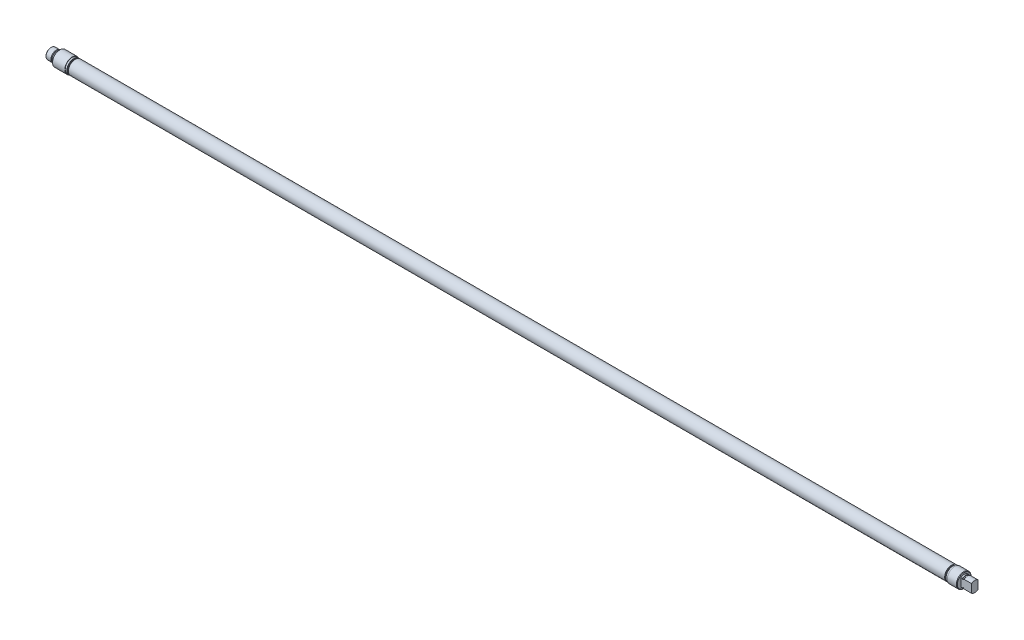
ISO-10303-21;
HEADER;
FILE_DESCRIPTION(('STEP AP214'),'2;1');
FILE_NAME('part.step','',(''),(''),'','','');
FILE_SCHEMA(('AUTOMOTIVE_DESIGN { 1 0 10303 214 1 1 1 1 }'));
ENDSEC;
DATA;
#1=APPLICATION_CONTEXT('core data for automotive mechanical design processes');
#2=APPLICATION_PROTOCOL_DEFINITION('international standard','automotive_design',2000,#1);
#3=PRODUCT_CONTEXT('',#1,'mechanical');
#4=PRODUCT('Part','Part','',(#3));
#5=PRODUCT_RELATED_PRODUCT_CATEGORY('part','',(#4));
#6=PRODUCT_DEFINITION_FORMATION('','',#4);
#7=PRODUCT_DEFINITION_CONTEXT('part definition',#1,'design');
#8=PRODUCT_DEFINITION('design','',#6,#7);
#9=PRODUCT_DEFINITION_SHAPE('','',#8);
#10=(LENGTH_UNIT() NAMED_UNIT(*) SI_UNIT(.MILLI.,.METRE.));
#11=(NAMED_UNIT(*) PLANE_ANGLE_UNIT() SI_UNIT($,.RADIAN.));
#12=(NAMED_UNIT(*) SI_UNIT($,.STERADIAN.) SOLID_ANGLE_UNIT());
#13=UNCERTAINTY_MEASURE_WITH_UNIT(LENGTH_MEASURE(1.E-05),#10,'distance_accuracy_value','');
#14=(GEOMETRIC_REPRESENTATION_CONTEXT(3) GLOBAL_UNCERTAINTY_ASSIGNED_CONTEXT((#13)) GLOBAL_UNIT_ASSIGNED_CONTEXT((#10,
#11,#12)) REPRESENTATION_CONTEXT('',''));
#15=CARTESIAN_POINT('',(0.,0.,0.));
#16=DIRECTION('',(0.,0.,1.));
#17=DIRECTION('',(1.,0.,0.));
#18=AXIS2_PLACEMENT_3D('',#15,#16,#17);
#19=CARTESIAN_POINT('',(-21.4174471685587,0.,0.));
#20=DIRECTION('',(-1.,0.,0.));
#21=DIRECTION('',(0.,0.,1.));
#22=AXIS2_PLACEMENT_3D('',#19,#20,#21);
#23=CYLINDRICAL_SURFACE('',#22,7.9121);
#24=CARTESIAN_POINT('',(1375.537,0.,0.));
#25=DIRECTION('',(-1.,0.,0.));
#26=DIRECTION('',(0.,0.,1.));
#27=AXIS2_PLACEMENT_3D('',#24,#25,#26);
#28=CIRCLE('',#27,7.9121);
#29=CARTESIAN_POINT('',(1375.537,-6.26985250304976,-4.82600000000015));
#30=VERTEX_POINT('',#29);
#31=CARTESIAN_POINT('',(1375.537,-6.26985250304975,4.82599999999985));
#32=VERTEX_POINT('',#31);
#33=EDGE_CURVE('E224',#30,#32,#28,.T.);
#34=ORIENTED_EDGE('',*,*,#33,.T.);
#35=DIRECTION('',(-1.,0.,0.));
#36=VECTOR('',#35,1.);
#37=CARTESIAN_POINT('',(-21.4174471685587,-6.26985250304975,4.82600000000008));
#38=LINE('',#37,#36);
#39=CARTESIAN_POINT('',(1364.3991,-6.26985250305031,4.82599999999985));
#40=VERTEX_POINT('',#39);
#41=EDGE_CURVE('E343',#32,#40,#38,.T.);
#42=ORIENTED_EDGE('',*,*,#41,.T.);
#43=CARTESIAN_POINT('',(1364.3991,0.,0.));
#44=DIRECTION('',(-1.,0.,0.));
#45=DIRECTION('',(0.,0.,1.));
#46=AXIS2_PLACEMENT_3D('',#43,#44,#45);
#47=CIRCLE('',#46,7.9121);
#48=CARTESIAN_POINT('',(1364.3991,-6.2698525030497,-4.82600000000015));
#49=VERTEX_POINT('',#48);
#50=EDGE_CURVE('E223',#49,#40,#47,.T.);
#51=ORIENTED_EDGE('',*,*,#50,.F.);
#52=DIRECTION('',(-1.,0.,0.));
#53=VECTOR('',#52,1.);
#54=CARTESIAN_POINT('',(-21.4174471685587,-6.26985250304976,-4.82600000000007));
#55=LINE('',#54,#53);
#56=EDGE_CURVE('E355',#49,#30,#55,.F.);
#57=ORIENTED_EDGE('',*,*,#56,.T.);
#58=EDGE_LOOP('',(#34,#42,#51,#57));
#59=FACE_BOUND('',#58,.T.);
#60=ADVANCED_FACE('F33',(#59),#23,.T.);
#61=CARTESIAN_POINT('',(1364.3991,0.,0.));
#62=DIRECTION('',(1.,0.,0.));
#63=DIRECTION('',(0.,0.,-1.));
#64=AXIS2_PLACEMENT_3D('',#61,#62,#63);
#65=CONICAL_SURFACE('',#64,7.9121,0.785398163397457);
#66=ORIENTED_EDGE('',*,*,#50,.T.);
#67=CARTESIAN_POINT('',(1373.90594860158,-16.7370694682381,4.82599999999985));
#68=CARTESIAN_POINT('',(1373.58662614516,-16.4047233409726,4.82599999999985));
#69=CARTESIAN_POINT('',(1373.26766915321,-16.0720250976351,4.82599999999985));
#70=CARTESIAN_POINT('',(1372.63066396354,-15.4057544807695,4.82599999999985));
#71=CARTESIAN_POINT('',(1372.31261577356,-15.0721820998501,4.82599999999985));
#72=CARTESIAN_POINT('',(1371.67751664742,-14.4038991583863,4.82599999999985));
#73=CARTESIAN_POINT('',(1371.36046603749,-14.0691882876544,4.82599999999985));
#74=CARTESIAN_POINT('',(1370.72770725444,-13.3985015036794,4.82599999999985));
#75=CARTESIAN_POINT('',(1370.41199907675,-13.0625255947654,4.82599999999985));
#76=CARTESIAN_POINT('',(1369.78534503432,-12.392323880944,4.82599999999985));
#77=CARTESIAN_POINT('',(1369.47438286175,-12.0581133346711,4.82599999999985));
#78=CARTESIAN_POINT('',(1368.85452235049,-11.3877842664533,4.82599999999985));
#79=CARTESIAN_POINT('',(1368.54562400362,-11.0516657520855,4.82599999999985));
#80=CARTESIAN_POINT('',(1367.93052154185,-10.3770472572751,4.82599999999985));
#81=CARTESIAN_POINT('',(1367.62431709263,-10.0385475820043,4.82599999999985));
#82=CARTESIAN_POINT('',(1367.01540490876,-9.35842140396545,4.82599999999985));
#83=CARTESIAN_POINT('',(1366.71269710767,-9.01679496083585,4.82599999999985));
#84=CARTESIAN_POINT('',(1366.18235482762,-8.40987321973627,4.82599999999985));
#85=CARTESIAN_POINT('',(1365.95373920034,-8.14543625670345,4.82599999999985));
#86=CARTESIAN_POINT('',(1365.50008982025,-7.61346524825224,4.82599999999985));
#87=CARTESIAN_POINT('',(1365.27505633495,-7.3459309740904,4.82599999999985));
#88=CARTESIAN_POINT('',(1364.82837422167,-6.80526290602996,4.82599999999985));
#89=CARTESIAN_POINT('',(1364.60675499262,-6.53210476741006,4.82599999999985));
#90=CARTESIAN_POINT('',(1364.17008432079,-5.98063379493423,4.82599999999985));
#91=CARTESIAN_POINT('',(1363.95503163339,-5.70232195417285,4.82599999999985));
#92=CARTESIAN_POINT('',(1363.63835391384,-5.27830105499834,4.82599999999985));
#93=CARTESIAN_POINT('',(1363.53328667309,-5.13516306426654,4.82599999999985));
#94=CARTESIAN_POINT('',(1363.32600872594,-4.84683695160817,4.82599999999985));
#95=CARTESIAN_POINT('',(1363.22379789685,-4.70164891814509,4.82599999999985));
#96=CARTESIAN_POINT('',(1363.02273516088,-4.40873141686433,4.82599999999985));
#97=CARTESIAN_POINT('',(1362.9238869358,-4.26099941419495,4.82599999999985));
#98=CARTESIAN_POINT('',(1362.73046369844,-3.96275813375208,4.82599999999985));
#99=CARTESIAN_POINT('',(1362.63588857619,-3.81224892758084,4.82599999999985));
#100=CARTESIAN_POINT('',(1362.45260166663,-3.50893747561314,4.82599999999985));
#101=CARTESIAN_POINT('',(1362.36385763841,-3.35615481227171,4.82599999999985));
#102=CARTESIAN_POINT('',(1362.19290845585,-3.04691994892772,4.82599999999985));
#103=CARTESIAN_POINT('',(1362.11070427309,-2.89046720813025,4.82599999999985));
#104=CARTESIAN_POINT('',(1361.95468120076,-2.57375531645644,4.82599999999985));
#105=CARTESIAN_POINT('',(1361.88084725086,-2.41350365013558,4.82599999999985));
#106=CARTESIAN_POINT('',(1361.74353326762,-2.08866262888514,4.82599999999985));
#107=CARTESIAN_POINT('',(1361.68004829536,-1.92407538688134,4.82599999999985));
#108=CARTESIAN_POINT('',(1361.56721256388,-1.59427630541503,4.82599999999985));
#109=CARTESIAN_POINT('',(1361.51757109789,-1.42916531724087,4.82599999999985));
#110=CARTESIAN_POINT('',(1361.4330687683,-1.0951641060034,4.82599999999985));
#111=CARTESIAN_POINT('',(1361.39820548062,-0.926274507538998,4.82599999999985));
#112=CARTESIAN_POINT('',(1361.34568462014,-0.586884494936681,4.82599999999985));
#113=CARTESIAN_POINT('',(1361.32791923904,-0.416401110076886,4.82599999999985));
#114=CARTESIAN_POINT('',(1361.31055646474,-0.0745027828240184,4.82599999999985));
#115=CARTESIAN_POINT('',(1361.31095771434,0.0969120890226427,4.82599999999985));
#116=CARTESIAN_POINT('',(1361.32988746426,0.438617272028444,4.82599999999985));
#117=CARTESIAN_POINT('',(1361.34840570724,0.60890816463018,4.82599999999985));
#118=CARTESIAN_POINT('',(1361.40216603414,0.946807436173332,4.82599999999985));
#119=CARTESIAN_POINT('',(1361.43741147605,1.11441526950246,4.82599999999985));
#120=CARTESIAN_POINT('',(1361.52270340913,1.44710546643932,4.82599999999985));
#121=CARTESIAN_POINT('',(1361.57285960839,1.61215921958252,4.82599999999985));
#122=CARTESIAN_POINT('',(1361.68533860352,1.93799977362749,4.82599999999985));
#123=CARTESIAN_POINT('',(1361.74766126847,2.09878662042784,4.82599999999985));
#124=CARTESIAN_POINT('',(1361.90172768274,2.46241963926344,4.82599999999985));
#125=CARTESIAN_POINT('',(1361.99675220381,2.66386534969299,4.82599999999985));
#126=CARTESIAN_POINT('',(1362.19909667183,3.06053751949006,4.82599999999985));
#127=CARTESIAN_POINT('',(1362.30642427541,3.2557600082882,4.82599999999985));
#128=CARTESIAN_POINT('',(1362.53052836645,3.64123509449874,4.82599999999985));
#129=CARTESIAN_POINT('',(1362.64732513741,3.83147580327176,4.82599999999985));
#130=CARTESIAN_POINT('',(1362.88790699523,4.20739530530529,4.82599999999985));
#131=CARTESIAN_POINT('',(1363.01169055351,4.39307508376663,4.82599999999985));
#132=CARTESIAN_POINT('',(1363.26597082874,4.76259550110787,4.82599999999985));
#133=CARTESIAN_POINT('',(1363.3965236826,4.94639732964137,4.82599999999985));
#134=CARTESIAN_POINT('',(1363.66194794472,5.31085556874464,4.82599999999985));
#135=CARTESIAN_POINT('',(1363.79681953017,5.49151184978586,4.82599999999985));
#136=CARTESIAN_POINT('',(1364.06979804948,5.84995870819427,4.82599999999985));
#137=CARTESIAN_POINT('',(1364.20790021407,6.02775292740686,4.82599999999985));
#138=CARTESIAN_POINT('',(1364.48685645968,6.38115864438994,4.82599999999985));
#139=CARTESIAN_POINT('',(1364.62771048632,6.55677018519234,4.82599999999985));
#140=CARTESIAN_POINT('',(1364.95291531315,6.95691921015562,4.82599999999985));
#141=CARTESIAN_POINT('',(1365.13801407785,7.18084819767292,4.82599999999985));
#142=CARTESIAN_POINT('',(1365.51114634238,7.62625117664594,4.82599999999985));
#143=CARTESIAN_POINT('',(1365.69917991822,7.84772510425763,4.82599999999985));
#144=CARTESIAN_POINT('',(1366.07760458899,8.28868097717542,4.82599999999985));
#145=CARTESIAN_POINT('',(1366.26799589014,8.5081627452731,4.82599999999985));
#146=CARTESIAN_POINT('',(1366.65068109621,8.94546255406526,4.82599999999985));
#147=CARTESIAN_POINT('',(1366.84297501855,9.16328057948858,4.82599999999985));
#148=CARTESIAN_POINT('',(1367.42255153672,9.81507831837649,4.82599999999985));
#149=CARTESIAN_POINT('',(1367.81216723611,10.2469830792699,4.82599999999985));
#150=CARTESIAN_POINT('',(1368.59569783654,11.1068205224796,4.82599999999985));
#151=CARTESIAN_POINT('',(1368.98961251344,11.5347534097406,4.82599999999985));
#152=CARTESIAN_POINT('',(1369.75804605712,12.3633732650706,4.82599999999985));
#153=CARTESIAN_POINT('',(1370.13239015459,12.7642224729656,4.82599999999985));
#154=CARTESIAN_POINT('',(1370.88322300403,13.5639176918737,4.82599999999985));
#155=CARTESIAN_POINT('',(1371.25971179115,13.9627636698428,4.82599999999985));
#156=CARTESIAN_POINT('',(1372.0137476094,14.7582414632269,4.82599999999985));
#157=CARTESIAN_POINT('',(1372.39129198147,15.1548758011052,4.82599999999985));
#158=CARTESIAN_POINT('',(1373.14770508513,15.9468593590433,4.82599999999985));
#159=CARTESIAN_POINT('',(1373.52657378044,16.3422086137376,4.82599999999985));
#160=CARTESIAN_POINT('',(1373.90594860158,16.7370694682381,4.82599999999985));
#161=B_SPLINE_CURVE_WITH_KNOTS('',3,(#67,#68,#69,#70,#71,#72,#73,#74,#75,#76,#77,#78,#79,#80,
#81,#82,#83,#84,#85,#86,#87,#88,#89,#90,#91,#92,#93,#94,#95,#96,#97,#98,#99,#100,#101,#102,#103,
#104,#105,#106,#107,#108,#109,#110,#111,#112,#113,#114,#115,#116,#117,#118,#119,#120,#121,#122,
#123,#124,#125,#126,#127,#128,#129,#130,#131,#132,#133,#134,#135,#136,#137,#138,#139,#140,#141,
#142,#143,#144,#145,#146,#147,#148,#149,#150,#151,#152,#153,#154,#155,#156,#157,#158,#159,#160),
.UNSPECIFIED.,.F.,.F.,(4,2,2,2,2,2,2,2,2,2,2,2,2,2,2,2,2,2,2,2,2,2,2,2,2,2,2,2,2,2,2,2,2,2,2,2,
2,2,2,2,2,2,2,2,2,2,4),(0.,1.38267463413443,2.76536099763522,4.14846033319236,5.53155494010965,
6.90105453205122,8.27054868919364,9.63987041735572,11.0091660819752,12.0578217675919,
13.1065553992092,14.1617507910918,15.2167449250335,15.7493982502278,16.282028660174,
16.8152246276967,17.3484068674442,17.8783374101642,18.4083465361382,18.9373863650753,
19.4661729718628,19.9828350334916,20.4994123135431,21.0127106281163,21.5259705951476,
22.0389401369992,22.5520127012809,23.068957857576,23.5858974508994,24.2535082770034,
24.9215368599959,25.5910362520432,26.2603897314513,26.936657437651,27.6129529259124,
28.2883061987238,28.9636461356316,29.8351924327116,30.7067613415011,31.5784070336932,
32.4500607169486,34.1950274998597,35.9399037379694,37.5852877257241,39.2306987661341,
40.8734756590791,42.5162079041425),.UNSPECIFIED.);
#162=CARTESIAN_POINT('',(1363.599,-5.22400880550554,4.82600000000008));
#163=VERTEX_POINT('',#162);
#164=EDGE_CURVE('E510',#40,#163,#161,.T.);
#165=ORIENTED_EDGE('',*,*,#164,.T.);
#166=CARTESIAN_POINT('',(1363.599,0.,0.));
#167=DIRECTION('',(-1.,0.,0.));
#168=DIRECTION('',(0.,0.,1.));
#169=AXIS2_PLACEMENT_3D('',#166,#167,#168);
#170=CIRCLE('',#169,7.11200000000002);
#171=CARTESIAN_POINT('',(1363.599,-5.22400880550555,-4.82600000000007));
#172=VERTEX_POINT('',#171);
#173=EDGE_CURVE('E232',#172,#163,#170,.T.);
#174=ORIENTED_EDGE('',*,*,#173,.F.);
#175=CARTESIAN_POINT('',(1373.90594860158,16.737069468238,-4.82600000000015));
#176=CARTESIAN_POINT('',(1373.58662614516,16.4047233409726,-4.82600000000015));
#177=CARTESIAN_POINT('',(1373.26766915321,16.0720250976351,-4.82600000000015));
#178=CARTESIAN_POINT('',(1372.63066396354,15.4057544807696,-4.82600000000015));
#179=CARTESIAN_POINT('',(1372.31261577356,15.0721820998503,-4.82600000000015));
#180=CARTESIAN_POINT('',(1371.67751664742,14.4038991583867,-4.82600000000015));
#181=CARTESIAN_POINT('',(1371.36046603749,14.0691882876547,-4.82600000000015));
#182=CARTESIAN_POINT('',(1370.72770725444,13.3985015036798,-4.82600000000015));
#183=CARTESIAN_POINT('',(1370.41199907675,13.0625255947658,-4.82600000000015));
#184=CARTESIAN_POINT('',(1369.78534503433,12.3923238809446,-4.82600000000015));
#185=CARTESIAN_POINT('',(1369.47438286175,12.0581133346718,-4.82600000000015));
#186=CARTESIAN_POINT('',(1368.85452235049,11.3877842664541,-4.82600000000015));
#187=CARTESIAN_POINT('',(1368.54562400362,11.0516657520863,-4.82600000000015));
#188=CARTESIAN_POINT('',(1367.93052154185,10.3770472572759,-4.82600000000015));
#189=CARTESIAN_POINT('',(1367.62431709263,10.0385475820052,-4.82600000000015));
#190=CARTESIAN_POINT('',(1367.01540490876,9.35842140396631,-4.82600000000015));
#191=CARTESIAN_POINT('',(1366.71269710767,9.01679496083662,-4.82600000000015));
#192=CARTESIAN_POINT('',(1366.18235482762,8.40987321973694,-4.82600000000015));
#193=CARTESIAN_POINT('',(1365.95373920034,8.14543625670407,-4.82600000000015));
#194=CARTESIAN_POINT('',(1365.50008982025,7.61346524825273,-4.82600000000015));
#195=CARTESIAN_POINT('',(1365.27505633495,7.34593097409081,-4.82600000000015));
#196=CARTESIAN_POINT('',(1364.82837422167,6.8052629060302,-4.82600000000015));
#197=CARTESIAN_POINT('',(1364.60675499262,6.5321047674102,-4.82600000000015));
#198=CARTESIAN_POINT('',(1364.17008432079,5.98063379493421,-4.82600000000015));
#199=CARTESIAN_POINT('',(1363.95503163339,5.70232195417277,-4.82600000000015));
#200=CARTESIAN_POINT('',(1363.63835391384,5.27830105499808,-4.82600000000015));
#201=CARTESIAN_POINT('',(1363.53328667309,5.13516306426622,-4.82600000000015));
#202=CARTESIAN_POINT('',(1363.32600872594,4.84683695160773,-4.82600000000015));
#203=CARTESIAN_POINT('',(1363.22379789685,4.7016489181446,-4.82600000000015));
#204=CARTESIAN_POINT('',(1363.02273516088,4.40873141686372,-4.82600000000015));
#205=CARTESIAN_POINT('',(1362.9238869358,4.26099941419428,-4.82600000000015));
#206=CARTESIAN_POINT('',(1362.73046369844,3.96275813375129,-4.82600000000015));
#207=CARTESIAN_POINT('',(1362.63588857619,3.81224892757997,-4.82600000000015));
#208=CARTESIAN_POINT('',(1362.45260166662,3.50893747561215,-4.82600000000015));
#209=CARTESIAN_POINT('',(1362.36385763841,3.35615481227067,-4.82600000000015));
#210=CARTESIAN_POINT('',(1362.19290845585,3.04691994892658,-4.82600000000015));
#211=CARTESIAN_POINT('',(1362.11070427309,2.89046720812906,-4.82600000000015));
#212=CARTESIAN_POINT('',(1361.95468120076,2.57375531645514,-4.82600000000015));
#213=CARTESIAN_POINT('',(1361.88084725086,2.41350365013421,-4.82600000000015));
#214=CARTESIAN_POINT('',(1361.74353326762,2.08866262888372,-4.82600000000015));
#215=CARTESIAN_POINT('',(1361.68004829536,1.92407538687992,-4.82600000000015));
#216=CARTESIAN_POINT('',(1361.56721256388,1.5942763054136,-4.82600000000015));
#217=CARTESIAN_POINT('',(1361.51757109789,1.4291653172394,-4.82600000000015));
#218=CARTESIAN_POINT('',(1361.4330687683,1.09516410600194,-4.82600000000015));
#219=CARTESIAN_POINT('',(1361.39820548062,0.926274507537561,-4.82600000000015));
#220=CARTESIAN_POINT('',(1361.34568462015,0.58688449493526,-4.82600000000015));
#221=CARTESIAN_POINT('',(1361.32791923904,0.416401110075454,-4.82600000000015));
#222=CARTESIAN_POINT('',(1361.31055646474,0.0745027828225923,-4.82600000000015));
#223=CARTESIAN_POINT('',(1361.31095771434,-0.0969120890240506,-4.82600000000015));
#224=CARTESIAN_POINT('',(1361.32988746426,-0.438617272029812,-4.82600000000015));
#225=CARTESIAN_POINT('',(1361.34840570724,-0.608908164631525,-4.82600000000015));
#226=CARTESIAN_POINT('',(1361.40216603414,-0.946807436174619,-4.82600000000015));
#227=CARTESIAN_POINT('',(1361.43741147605,-1.11441526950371,-4.82600000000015));
#228=CARTESIAN_POINT('',(1361.52270340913,-1.44710546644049,-4.82600000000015));
#229=CARTESIAN_POINT('',(1361.57285960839,-1.61215921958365,-4.82600000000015));
#230=CARTESIAN_POINT('',(1361.68533860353,-1.93799977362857,-4.82600000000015));
#231=CARTESIAN_POINT('',(1361.74766126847,-2.09878662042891,-4.82600000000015));
#232=CARTESIAN_POINT('',(1361.90172768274,-2.46241963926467,-4.82600000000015));
#233=CARTESIAN_POINT('',(1361.99675220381,-2.66386534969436,-4.82600000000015));
#234=CARTESIAN_POINT('',(1362.19909667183,-3.06053751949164,-4.82600000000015));
#235=CARTESIAN_POINT('',(1362.30642427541,-3.25576000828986,-4.82600000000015));
#236=CARTESIAN_POINT('',(1362.53052836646,-3.64123509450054,-4.82600000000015));
#237=CARTESIAN_POINT('',(1362.64732513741,-3.83147580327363,-4.82600000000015));
#238=CARTESIAN_POINT('',(1362.88790699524,-4.20739530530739,-4.82600000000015));
#239=CARTESIAN_POINT('',(1363.01169055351,-4.39307508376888,-4.82600000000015));
#240=CARTESIAN_POINT('',(1363.26597082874,-4.76259550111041,-4.82600000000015));
#241=CARTESIAN_POINT('',(1363.3965236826,-4.94639732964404,-4.82600000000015));
#242=CARTESIAN_POINT('',(1363.66194794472,-5.31085556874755,-4.82600000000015));
#243=CARTESIAN_POINT('',(1363.79681953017,-5.49151184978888,-4.82600000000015));
#244=CARTESIAN_POINT('',(1364.06979804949,-5.84995870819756,-4.82600000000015));
#245=CARTESIAN_POINT('',(1364.20790021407,-6.02775292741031,-4.82600000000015));
#246=CARTESIAN_POINT('',(1364.48685645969,-6.38115864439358,-4.82600000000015));
#247=CARTESIAN_POINT('',(1364.62771048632,-6.556770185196,-4.82600000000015));
#248=CARTESIAN_POINT('',(1364.95291531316,-6.95691921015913,-4.82600000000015));
#249=CARTESIAN_POINT('',(1365.13801407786,-7.18084819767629,-4.82600000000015));
#250=CARTESIAN_POINT('',(1365.51114634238,-7.62625117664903,-4.82600000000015));
#251=CARTESIAN_POINT('',(1365.69917991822,-7.84772510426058,-4.82600000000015));
#252=CARTESIAN_POINT('',(1366.07760458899,-8.28868097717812,-4.82600000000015));
#253=CARTESIAN_POINT('',(1366.26799589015,-8.50816274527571,-4.82600000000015));
#254=CARTESIAN_POINT('',(1366.65068109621,-8.94546255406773,-4.82600000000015));
#255=CARTESIAN_POINT('',(1366.84297501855,-9.16328057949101,-4.82600000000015));
#256=CARTESIAN_POINT('',(1367.42255153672,-9.81507831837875,-4.82600000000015));
#257=CARTESIAN_POINT('',(1367.81216723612,-10.2469830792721,-4.82600000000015));
#258=CARTESIAN_POINT('',(1368.59569783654,-11.1068205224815,-4.82600000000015));
#259=CARTESIAN_POINT('',(1368.98961251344,-11.5347534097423,-4.82600000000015));
#260=CARTESIAN_POINT('',(1369.75804605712,-12.3633732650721,-4.82600000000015));
#261=CARTESIAN_POINT('',(1370.13239015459,-12.764222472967,-4.82600000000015));
#262=CARTESIAN_POINT('',(1370.88322300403,-13.5639176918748,-4.82600000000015));
#263=CARTESIAN_POINT('',(1371.25971179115,-13.9627636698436,-4.82600000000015));
#264=CARTESIAN_POINT('',(1372.0137476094,-14.7582414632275,-4.82600000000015));
#265=CARTESIAN_POINT('',(1372.39129198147,-15.1548758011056,-4.82600000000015));
#266=CARTESIAN_POINT('',(1373.14770508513,-15.9468593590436,-4.82600000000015));
#267=CARTESIAN_POINT('',(1373.52657378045,-16.3422086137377,-4.82600000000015));
#268=CARTESIAN_POINT('',(1373.90594860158,-16.7370694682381,-4.82600000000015));
#269=B_SPLINE_CURVE_WITH_KNOTS('',3,(#175,#176,#177,#178,#179,#180,#181,#182,#183,#184,#185,
#186,#187,#188,#189,#190,#191,#192,#193,#194,#195,#196,#197,#198,#199,#200,#201,#202,#203,#204,
#205,#206,#207,#208,#209,#210,#211,#212,#213,#214,#215,#216,#217,#218,#219,#220,#221,#222,#223,
#224,#225,#226,#227,#228,#229,#230,#231,#232,#233,#234,#235,#236,#237,#238,#239,#240,#241,#242,
#243,#244,#245,#246,#247,#248,#249,#250,#251,#252,#253,#254,#255,#256,#257,#258,#259,#260,#261,
#262,#263,#264,#265,#266,#267,#268),.UNSPECIFIED.,.F.,.F.,(4,2,2,2,2,2,2,2,2,2,2,2,2,2,2,2,2,2,
2,2,2,2,2,2,2,2,2,2,2,2,2,2,2,2,2,2,2,2,2,2,2,2,2,2,2,2,4),(0.,1.3826746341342,2.76536099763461,
4.14846033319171,5.53155494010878,6.90105453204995,8.2705486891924,9.63987041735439,
11.009166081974,12.057821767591,13.1065553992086,14.1617507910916,15.2167449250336,
15.749398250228,16.2820286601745,16.8152246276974,17.348406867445,17.8783374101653,
18.4083465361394,18.9373863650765,19.4661729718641,19.9828350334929,20.4994123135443,
21.0127106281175,21.5259705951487,22.0389401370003,22.5520127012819,23.0689578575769,
23.5858974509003,24.2535082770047,24.9215368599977,25.5910362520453,26.2603897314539,
26.9366574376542,27.6129529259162,28.288306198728,28.9636461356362,29.8351924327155,
30.7067613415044,31.5784070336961,32.4500607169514,34.195027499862,35.9399037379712,
37.5852877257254,39.2306987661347,40.8734756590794,42.516207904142),.UNSPECIFIED.);
#270=EDGE_CURVE('E264',#172,#49,#269,.T.);
#271=ORIENTED_EDGE('',*,*,#270,.T.);
#272=EDGE_LOOP('',(#66,#165,#174,#271));
#273=FACE_BOUND('',#272,.T.);
#274=ADVANCED_FACE('F189',(#273),#65,.T.);
#275=CARTESIAN_POINT('',(-21.4174471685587,0.,0.));
#276=DIRECTION('',(-1.,0.,0.));
#277=DIRECTION('',(0.,0.,1.));
#278=AXIS2_PLACEMENT_3D('',#275,#276,#277);
#279=CYLINDRICAL_SURFACE('',#278,7.11200000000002);
#280=ORIENTED_EDGE('',*,*,#173,.T.);
#281=DIRECTION('',(-1.,0.,0.));
#282=VECTOR('',#281,1.);
#283=CARTESIAN_POINT('',(-21.4174471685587,-5.22400880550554,4.82600000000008));
#284=LINE('',#283,#282);
#285=CARTESIAN_POINT('',(1362.075,-5.22400880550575,4.82599999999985));
#286=VERTEX_POINT('',#285);
#287=EDGE_CURVE('E507',#163,#286,#284,.T.);
#288=ORIENTED_EDGE('',*,*,#287,.T.);
#289=CARTESIAN_POINT('',(1362.075,0.,0.));
#290=DIRECTION('',(-1.,0.,0.));
#291=DIRECTION('',(0.,0.,1.));
#292=AXIS2_PLACEMENT_3D('',#289,#290,#291);
#293=CIRCLE('',#292,7.11200000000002);
#294=CARTESIAN_POINT('',(1362.075,-5.22400880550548,-4.82600000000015));
#295=VERTEX_POINT('',#294);
#296=EDGE_CURVE('E235',#295,#286,#293,.T.);
#297=ORIENTED_EDGE('',*,*,#296,.F.);
#298=DIRECTION('',(-1.,0.,0.));
#299=VECTOR('',#298,1.);
#300=CARTESIAN_POINT('',(-21.4174471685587,-5.22400880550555,-4.82600000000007));
#301=LINE('',#300,#299);
#302=EDGE_CURVE('E348',#295,#172,#301,.F.);
#303=ORIENTED_EDGE('',*,*,#302,.T.);
#304=EDGE_LOOP('',(#280,#288,#297,#303));
#305=FACE_BOUND('',#304,.T.);
#306=ADVANCED_FACE('F196',(#305),#279,.T.);
#307=CARTESIAN_POINT('',(1362.075,7.9121,0.));
#308=DIRECTION('',(-1.,0.,0.));
#309=DIRECTION('',(0.,0.,1.));
#310=AXIS2_PLACEMENT_3D('',#307,#308,#309);
#311=PLANE('',#310);
#312=CARTESIAN_POINT('',(1362.075,0.,0.));
#313=DIRECTION('',(-1.,0.,0.));
#314=DIRECTION('',(0.,0.,1.));
#315=AXIS2_PLACEMENT_3D('',#312,#313,#314);
#316=CIRCLE('',#315,7.9121);
#317=CARTESIAN_POINT('',(1362.075,6.26985250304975,4.82600000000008));
#318=VERTEX_POINT('',#317);
#319=CARTESIAN_POINT('',(1362.075,6.26985250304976,-4.82600000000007));
#320=VERTEX_POINT('',#319);
#321=EDGE_CURVE('E237',#318,#320,#316,.T.);
#322=ORIENTED_EDGE('',*,*,#321,.F.);
#323=DIRECTION('',(0.,-1.,0.));
#324=VECTOR('',#323,1.);
#325=CARTESIAN_POINT('',(1362.075,7.9121,4.82599999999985));
#326=LINE('',#325,#324);
#327=CARTESIAN_POINT('',(1362.075,5.22400880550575,4.82599999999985));
#328=VERTEX_POINT('',#327);
#329=EDGE_CURVE('E48',#318,#328,#326,.T.);
#330=ORIENTED_EDGE('',*,*,#329,.T.);
#331=CARTESIAN_POINT('',(1362.075,5.22400880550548,-4.82600000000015));
#332=VERTEX_POINT('',#331);
#333=EDGE_CURVE('E234',#328,#332,#293,.T.);
#334=ORIENTED_EDGE('',*,*,#333,.T.);
#335=DIRECTION('',(0.,1.,0.));
#336=VECTOR('',#335,1.);
#337=CARTESIAN_POINT('',(1362.075,7.9121,-4.82600000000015));
#338=LINE('',#337,#336);
#339=EDGE_CURVE('E247',#332,#320,#338,.T.);
#340=ORIENTED_EDGE('',*,*,#339,.T.);
#341=EDGE_LOOP('',(#322,#330,#334,#340));
#342=FACE_BOUND('',#341,.T.);
#343=ADVANCED_FACE('F246',(#342),#311,.F.);
#344=CARTESIAN_POINT('',(-21.4174471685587,0.,0.));
#345=DIRECTION('',(-1.,0.,0.));
#346=DIRECTION('',(0.,0.,1.));
#347=AXIS2_PLACEMENT_3D('',#344,#345,#346);
#348=CYLINDRICAL_SURFACE('',#347,7.9121);
#349=CARTESIAN_POINT('',(1362.075,-6.26985250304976,-4.82600000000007));
#350=VERTEX_POINT('',#349);
#351=CARTESIAN_POINT('',(1362.075,-6.26985250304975,4.82600000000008));
#352=VERTEX_POINT('',#351);
#353=EDGE_CURVE('E137',#350,#352,#316,.T.);
#354=ORIENTED_EDGE('',*,*,#353,.T.);
#355=DIRECTION('',(-1.,0.,0.));
#356=VECTOR('',#355,1.);
#357=CARTESIAN_POINT('',(-21.4174471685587,-6.26985250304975,4.82600000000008));
#358=LINE('',#357,#356);
#359=CARTESIAN_POINT('',(1359.789,-6.26985250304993,4.82599999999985));
#360=VERTEX_POINT('',#359);
#361=EDGE_CURVE('E124',#352,#360,#358,.T.);
#362=ORIENTED_EDGE('',*,*,#361,.T.);
#363=CARTESIAN_POINT('',(1359.789,0.,0.));
#364=DIRECTION('',(-1.,0.,0.));
#365=DIRECTION('',(0.,0.,1.));
#366=AXIS2_PLACEMENT_3D('',#363,#364,#365);
#367=CIRCLE('',#366,7.9121);
#368=CARTESIAN_POINT('',(1359.789,-6.2698525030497,-4.82600000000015));
#369=VERTEX_POINT('',#368);
#370=EDGE_CURVE('E135',#369,#360,#367,.T.);
#371=ORIENTED_EDGE('',*,*,#370,.F.);
#372=DIRECTION('',(-1.,0.,0.));
#373=VECTOR('',#372,1.);
#374=CARTESIAN_POINT('',(-21.4174471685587,-6.26985250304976,-4.82600000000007));
#375=LINE('',#374,#373);
#376=EDGE_CURVE('E340',#369,#350,#375,.F.);
#377=ORIENTED_EDGE('',*,*,#376,.T.);
#378=EDGE_LOOP('',(#354,#362,#371,#377));
#379=FACE_BOUND('',#378,.T.);
#380=ADVANCED_FACE('F133',(#379),#348,.T.);
#381=CARTESIAN_POINT('',(-21.4174471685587,0.,0.));
#382=DIRECTION('',(-1.,0.,0.));
#383=DIRECTION('',(0.,0.,1.));
#384=AXIS2_PLACEMENT_3D('',#381,#382,#383);
#385=CYLINDRICAL_SURFACE('',#384,10.2870000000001);
#386=CARTESIAN_POINT('',(1341.755,0.,0.));
#387=DIRECTION('',(-1.,0.,0.));
#388=DIRECTION('',(0.,0.,1.));
#389=AXIS2_PLACEMENT_3D('',#386,#387,#388);
#390=CIRCLE('',#389,10.287);
#391=CARTESIAN_POINT('',(1341.755,0.,10.287));
#392=VERTEX_POINT('',#391);
#393=EDGE_CURVE('E281',#392,#392,#390,.T.);
#394=ORIENTED_EDGE('',*,*,#393,.F.);
#395=EDGE_LOOP('',(#394));
#396=FACE_BOUND('',#395,.T.);
#397=CARTESIAN_POINT('',(1342.263,0.,0.));
#398=DIRECTION('',(-1.,0.,0.));
#399=DIRECTION('',(0.,0.,1.));
#400=AXIS2_PLACEMENT_3D('',#397,#398,#399);
#401=CIRCLE('',#400,10.287);
#402=CARTESIAN_POINT('',(1342.263,0.,10.287));
#403=VERTEX_POINT('',#402);
#404=EDGE_CURVE('E269',#403,#403,#401,.T.);
#405=ORIENTED_EDGE('',*,*,#404,.T.);
#406=EDGE_LOOP('',(#405));
#407=FACE_BOUND('',#406,.T.);
#408=ADVANCED_FACE('F485',(#396,#407),#385,.T.);
#409=CARTESIAN_POINT('',(36.449,0.,0.));
#410=DIRECTION('',(-1.,0.,0.));
#411=DIRECTION('',(0.,0.,1.));
#412=AXIS2_PLACEMENT_3D('',#409,#410,#411);
#413=CIRCLE('',#412,10.287);
#414=CARTESIAN_POINT('',(36.449,0.,10.287));
#415=VERTEX_POINT('',#414);
#416=EDGE_CURVE('E299',#415,#415,#413,.T.);
#417=ORIENTED_EDGE('',*,*,#416,.F.);
#418=EDGE_LOOP('',(#417));
#419=FACE_BOUND('',#418,.T.);
#420=CARTESIAN_POINT('',(1340.993,0.,0.));
#421=DIRECTION('',(-1.,0.,0.));
#422=DIRECTION('',(0.,0.,1.));
#423=AXIS2_PLACEMENT_3D('',#420,#421,#422);
#424=CIRCLE('',#423,10.287);
#425=CARTESIAN_POINT('',(1340.993,0.,10.287));
#426=VERTEX_POINT('',#425);
#427=EDGE_CURVE('E284',#426,#426,#424,.T.);
#428=ORIENTED_EDGE('',*,*,#427,.T.);
#429=EDGE_LOOP('',(#428));
#430=FACE_BOUND('',#429,.T.);
#431=ADVANCED_FACE('F484',(#419,#430),#385,.T.);
#432=CARTESIAN_POINT('',(35.179,0.,0.));
#433=DIRECTION('',(-1.,0.,0.));
#434=DIRECTION('',(0.,0.,1.));
#435=AXIS2_PLACEMENT_3D('',#432,#433,#434);
#436=CIRCLE('',#435,10.287);
#437=CARTESIAN_POINT('',(35.179,0.,10.287));
#438=VERTEX_POINT('',#437);
#439=EDGE_CURVE('E308',#438,#438,#436,.T.);
#440=ORIENTED_EDGE('',*,*,#439,.F.);
#441=EDGE_LOOP('',(#440));
#442=FACE_BOUND('',#441,.T.);
#443=CARTESIAN_POINT('',(35.56,0.,0.));
#444=DIRECTION('',(-1.,0.,0.));
#445=DIRECTION('',(0.,0.,1.));
#446=AXIS2_PLACEMENT_3D('',#443,#444,#445);
#447=CIRCLE('',#446,10.287);
#448=CARTESIAN_POINT('',(35.56,0.,10.287));
#449=VERTEX_POINT('',#448);
#450=EDGE_CURVE('E305',#449,#449,#447,.T.);
#451=ORIENTED_EDGE('',*,*,#450,.T.);
#452=EDGE_LOOP('',(#451));
#453=FACE_BOUND('',#452,.T.);
#454=ADVANCED_FACE('F533',(#442,#453),#385,.T.);
#455=CARTESIAN_POINT('',(31.75,0.,0.));
#456=DIRECTION('',(-1.,0.,0.));
#457=DIRECTION('',(0.,0.,1.));
#458=AXIS2_PLACEMENT_3D('',#455,#456,#457);
#459=CIRCLE('',#458,10.287);
#460=CARTESIAN_POINT('',(31.75,0.,10.287));
#461=VERTEX_POINT('',#460);
#462=EDGE_CURVE('E153',#461,#461,#459,.T.);
#463=ORIENTED_EDGE('',*,*,#462,.F.);
#464=EDGE_LOOP('',(#463));
#465=FACE_BOUND('',#464,.T.);
#466=CARTESIAN_POINT('',(34.29,0.,0.));
#467=DIRECTION('',(-1.,0.,0.));
#468=DIRECTION('',(0.,0.,1.));
#469=AXIS2_PLACEMENT_3D('',#466,#467,#468);
#470=CIRCLE('',#469,10.287);
#471=CARTESIAN_POINT('',(34.29,0.,10.287));
#472=VERTEX_POINT('',#471);
#473=EDGE_CURVE('E314',#472,#472,#470,.T.);
#474=ORIENTED_EDGE('',*,*,#473,.T.);
#475=EDGE_LOOP('',(#474));
#476=FACE_BOUND('',#475,.T.);
#477=ADVANCED_FACE('F452',(#465,#476),#385,.T.);
#478=CARTESIAN_POINT('',(-21.4174471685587,0.,0.));
#479=DIRECTION('',(-1.,0.,0.));
#480=DIRECTION('',(0.,0.,1.));
#481=AXIS2_PLACEMENT_3D('',#478,#479,#480);
#482=CYLINDRICAL_SURFACE('',#481,7.9121);
#483=CARTESIAN_POINT('',(10.414,0.,0.));
#484=DIRECTION('',(-1.,0.,0.));
#485=DIRECTION('',(0.,0.,1.));
#486=AXIS2_PLACEMENT_3D('',#483,#484,#485);
#487=CIRCLE('',#486,7.9121);
#488=CARTESIAN_POINT('',(10.414,0.,7.9121));
#489=VERTEX_POINT('',#488);
#490=EDGE_CURVE('E317',#489,#489,#487,.T.);
#491=ORIENTED_EDGE('',*,*,#490,.F.);
#492=EDGE_LOOP('',(#491));
#493=FACE_BOUND('',#492,.T.);
#494=CARTESIAN_POINT('',(12.7,0.,0.));
#495=DIRECTION('',(-1.,0.,0.));
#496=DIRECTION('',(0.,0.,1.));
#497=AXIS2_PLACEMENT_3D('',#494,#495,#496);
#498=CIRCLE('',#497,7.9121);
#499=CARTESIAN_POINT('',(12.7,0.,7.9121));
#500=VERTEX_POINT('',#499);
#501=EDGE_CURVE('E159',#500,#500,#498,.T.);
#502=ORIENTED_EDGE('',*,*,#501,.T.);
#503=EDGE_LOOP('',(#502));
#504=FACE_BOUND('',#503,.T.);
#505=ADVANCED_FACE('F457',(#493,#504),#482,.T.);
#506=CARTESIAN_POINT('',(12.7,10.922,0.));
#507=DIRECTION('',(1.,0.,0.));
#508=DIRECTION('',(0.,0.,-1.));
#509=AXIS2_PLACEMENT_3D('',#506,#507,#508);
#510=PLANE('',#509);
#511=CARTESIAN_POINT('',(12.7,0.,0.));
#512=DIRECTION('',(1.,0.,0.));
#513=DIRECTION('',(0.,0.,-1.));
#514=AXIS2_PLACEMENT_3D('',#511,#512,#513);
#515=CIRCLE('',#514,10.1600000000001);
#516=CARTESIAN_POINT('',(12.7,0.,-10.1600000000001));
#517=VERTEX_POINT('',#516);
#518=EDGE_CURVE('E168',#517,#517,#515,.F.);
#519=ORIENTED_EDGE('',*,*,#518,.T.);
#520=EDGE_LOOP('',(#519));
#521=FACE_BOUND('',#520,.T.);
#522=ORIENTED_EDGE('',*,*,#501,.F.);
#523=EDGE_LOOP('',(#522));
#524=FACE_BOUND('',#523,.T.);
#525=ADVANCED_FACE('F446',(#521,#524),#510,.F.);
#526=CARTESIAN_POINT('',(-21.4174471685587,0.,0.));
#527=DIRECTION('',(-1.,0.,0.));
#528=DIRECTION('',(0.,0.,1.));
#529=AXIS2_PLACEMENT_3D('',#526,#527,#528);
#530=CYLINDRICAL_SURFACE('',#529,10.922);
#531=CARTESIAN_POINT('',(13.462,0.,0.));
#532=DIRECTION('',(1.,0.,0.));
#533=DIRECTION('',(0.,0.,-1.));
#534=AXIS2_PLACEMENT_3D('',#531,#532,#533);
#535=CIRCLE('',#534,10.922);
#536=CARTESIAN_POINT('',(13.462,0.,-10.922));
#537=VERTEX_POINT('',#536);
#538=EDGE_CURVE('E171',#537,#537,#535,.T.);
#539=ORIENTED_EDGE('',*,*,#538,.T.);
#540=EDGE_LOOP('',(#539));
#541=FACE_BOUND('',#540,.T.);
#542=CARTESIAN_POINT('',(31.75,0.,0.));
#543=DIRECTION('',(-1.,0.,0.));
#544=DIRECTION('',(0.,0.,1.));
#545=AXIS2_PLACEMENT_3D('',#542,#543,#544);
#546=CIRCLE('',#545,10.922);
#547=CARTESIAN_POINT('',(31.75,0.,10.922));
#548=VERTEX_POINT('',#547);
#549=EDGE_CURVE('E156',#548,#548,#546,.T.);
#550=ORIENTED_EDGE('',*,*,#549,.T.);
#551=EDGE_LOOP('',(#550));
#552=FACE_BOUND('',#551,.T.);
#553=ADVANCED_FACE('F440',(#541,#552),#530,.T.);
#554=CARTESIAN_POINT('',(31.75,10.922,0.));
#555=DIRECTION('',(-1.,0.,0.));
#556=DIRECTION('',(0.,0.,1.));
#557=AXIS2_PLACEMENT_3D('',#554,#555,#556);
#558=PLANE('',#557);
#559=ORIENTED_EDGE('',*,*,#549,.F.);
#560=EDGE_LOOP('',(#559));
#561=FACE_BOUND('',#560,.T.);
#562=ORIENTED_EDGE('',*,*,#462,.T.);
#563=EDGE_LOOP('',(#562));
#564=FACE_BOUND('',#563,.T.);
#565=ADVANCED_FACE('F436',(#561,#564),#558,.F.);
#566=CARTESIAN_POINT('',(0.,7.9121,0.));
#567=DIRECTION('',(1.,0.,0.));
#568=DIRECTION('',(0.,0.,-1.));
#569=AXIS2_PLACEMENT_3D('',#566,#567,#568);
#570=PLANE('',#569);
#571=CARTESIAN_POINT('',(0.,0.,0.));
#572=DIRECTION('',(1.,0.,0.));
#573=DIRECTION('',(0.,0.,-1.));
#574=AXIS2_PLACEMENT_3D('',#571,#572,#573);
#575=CIRCLE('',#574,7.15009999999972);
#576=CARTESIAN_POINT('',(0.,0.,-7.15009999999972));
#577=VERTEX_POINT('',#576);
#578=EDGE_CURVE('E41',#577,#577,#575,.F.);
#579=ORIENTED_EDGE('',*,*,#578,.T.);
#580=EDGE_LOOP('',(#579));
#581=FACE_BOUND('',#580,.T.);
#582=CARTESIAN_POINT('',(0.,0.,0.));
#583=DIRECTION('',(1.,0.,0.));
#584=DIRECTION('',(0.,0.,-1.));
#585=AXIS2_PLACEMENT_3D('',#582,#583,#584);
#586=CIRCLE('',#585,3.175);
#587=CARTESIAN_POINT('',(0.,0.,-3.175));
#588=VERTEX_POINT('',#587);
#589=EDGE_CURVE('E287',#588,#588,#586,.T.);
#590=ORIENTED_EDGE('',*,*,#589,.T.);
#591=EDGE_LOOP('',(#590));
#592=FACE_BOUND('',#591,.T.);
#593=ADVANCED_FACE('F176',(#581,#592),#570,.F.);
#594=CARTESIAN_POINT('',(-21.4174471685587,0.,0.));
#595=DIRECTION('',(-1.,0.,0.));
#596=DIRECTION('',(0.,0.,1.));
#597=AXIS2_PLACEMENT_3D('',#594,#595,#596);
#598=CYLINDRICAL_SURFACE('',#597,7.9121);
#599=CARTESIAN_POINT('',(0.762000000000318,0.,0.));
#600=DIRECTION('',(1.,0.,0.));
#601=DIRECTION('',(0.,0.,-1.));
#602=AXIS2_PLACEMENT_3D('',#599,#600,#601);
#603=CIRCLE('',#602,7.9121);
#604=CARTESIAN_POINT('',(0.762000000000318,0.,-7.9121));
#605=VERTEX_POINT('',#604);
#606=EDGE_CURVE('E11',#605,#605,#603,.T.);
#607=ORIENTED_EDGE('',*,*,#606,.T.);
#608=EDGE_LOOP('',(#607));
#609=FACE_BOUND('',#608,.T.);
#610=CARTESIAN_POINT('',(8.08989999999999,0.,0.));
#611=DIRECTION('',(-1.,0.,0.));
#612=DIRECTION('',(0.,0.,1.));
#613=AXIS2_PLACEMENT_3D('',#610,#611,#612);
#614=CIRCLE('',#613,7.9121);
#615=CARTESIAN_POINT('',(8.08989999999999,0.,7.9121));
#616=VERTEX_POINT('',#615);
#617=EDGE_CURVE('E331',#616,#616,#614,.T.);
#618=ORIENTED_EDGE('',*,*,#617,.T.);
#619=EDGE_LOOP('',(#618));
#620=FACE_BOUND('',#619,.T.);
#621=ADVANCED_FACE('F430',(#609,#620),#598,.T.);
#622=CARTESIAN_POINT('',(8.74121024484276,0.,0.));
#623=DIRECTION('',(-1.,0.,0.));
#624=DIRECTION('',(0.,0.,1.));
#625=AXIS2_PLACEMENT_3D('',#622,#623,#624);
#626=CONICAL_SURFACE('',#625,7.26078975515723,0.785398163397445);
#627=ORIENTED_EDGE('',*,*,#617,.F.);
#628=EDGE_LOOP('',(#627));
#629=FACE_BOUND('',#628,.T.);
#630=CARTESIAN_POINT('',(8.74121024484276,0.,0.));
#631=DIRECTION('',(-1.,0.,0.));
#632=DIRECTION('',(0.,0.,1.));
#633=AXIS2_PLACEMENT_3D('',#630,#631,#632);
#634=CIRCLE('',#633,7.26078975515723);
#635=CARTESIAN_POINT('',(8.74121024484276,0.,7.26078975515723));
#636=VERTEX_POINT('',#635);
#637=EDGE_CURVE('E329',#636,#636,#634,.T.);
#638=ORIENTED_EDGE('',*,*,#637,.T.);
#639=EDGE_LOOP('',(#638));
#640=FACE_BOUND('',#639,.T.);
#641=ADVANCED_FACE('F426',(#629,#640),#626,.T.);
#642=CARTESIAN_POINT('',(9.10042048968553,0.,0.));
#643=DIRECTION('',(-1.,0.,0.));
#644=DIRECTION('',(0.,0.,1.));
#645=AXIS2_PLACEMENT_3D('',#642,#643,#644);
#646=TOROIDAL_SURFACE('',#645,7.62,0.507999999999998);
#647=ORIENTED_EDGE('',*,*,#637,.F.);
#648=EDGE_LOOP('',(#647));
#649=FACE_BOUND('',#648,.T.);
#650=CARTESIAN_POINT('',(9.10042048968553,0.,0.));
#651=DIRECTION('',(-1.,0.,0.));
#652=DIRECTION('',(0.,0.,1.));
#653=AXIS2_PLACEMENT_3D('',#650,#651,#652);
#654=CIRCLE('',#653,7.112);
#655=CARTESIAN_POINT('',(9.10042048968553,0.,7.112));
#656=VERTEX_POINT('',#655);
#657=EDGE_CURVE('E326',#656,#656,#654,.T.);
#658=ORIENTED_EDGE('',*,*,#657,.T.);
#659=EDGE_LOOP('',(#658));
#660=FACE_BOUND('',#659,.T.);
#661=ADVANCED_FACE('F422',(#649,#660),#646,.F.);
#662=CARTESIAN_POINT('',(-21.4174471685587,0.,0.));
#663=DIRECTION('',(-1.,0.,0.));
#664=DIRECTION('',(0.,0.,1.));
#665=AXIS2_PLACEMENT_3D('',#662,#663,#664);
#666=CYLINDRICAL_SURFACE('',#665,7.112);
#667=ORIENTED_EDGE('',*,*,#657,.F.);
#668=EDGE_LOOP('',(#667));
#669=FACE_BOUND('',#668,.T.);
#670=CARTESIAN_POINT('',(9.90599999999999,0.,0.));
#671=DIRECTION('',(-1.,0.,0.));
#672=DIRECTION('',(0.,0.,1.));
#673=AXIS2_PLACEMENT_3D('',#670,#671,#672);
#674=CIRCLE('',#673,7.112);
#675=CARTESIAN_POINT('',(9.90599999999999,0.,7.112));
#676=VERTEX_POINT('',#675);
#677=EDGE_CURVE('E323',#676,#676,#674,.T.);
#678=ORIENTED_EDGE('',*,*,#677,.T.);
#679=EDGE_LOOP('',(#678));
#680=FACE_BOUND('',#679,.T.);
#681=ADVANCED_FACE('F418',(#669,#680),#666,.T.);
#682=CARTESIAN_POINT('',(9.90599999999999,0.,0.));
#683=DIRECTION('',(-1.,0.,0.));
#684=DIRECTION('',(0.,0.,1.));
#685=AXIS2_PLACEMENT_3D('',#682,#683,#684);
#686=TOROIDAL_SURFACE('',#685,7.62,0.508000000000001);
#687=ORIENTED_EDGE('',*,*,#677,.F.);
#688=EDGE_LOOP('',(#687));
#689=FACE_BOUND('',#688,.T.);
#690=CARTESIAN_POINT('',(10.414,0.,0.));
#691=DIRECTION('',(-1.,0.,0.));
#692=DIRECTION('',(0.,0.,1.));
#693=AXIS2_PLACEMENT_3D('',#690,#691,#692);
#694=CIRCLE('',#693,7.62);
#695=CARTESIAN_POINT('',(10.414,0.,7.62));
#696=VERTEX_POINT('',#695);
#697=EDGE_CURVE('E320',#696,#696,#694,.T.);
#698=ORIENTED_EDGE('',*,*,#697,.T.);
#699=EDGE_LOOP('',(#698));
#700=FACE_BOUND('',#699,.T.);
#701=ADVANCED_FACE('F414',(#689,#700),#686,.F.);
#702=CARTESIAN_POINT('',(10.414,7.9121,0.));
#703=DIRECTION('',(1.,0.,0.));
#704=DIRECTION('',(0.,0.,-1.));
#705=AXIS2_PLACEMENT_3D('',#702,#703,#704);
#706=PLANE('',#705);
#707=ORIENTED_EDGE('',*,*,#697,.F.);
#708=EDGE_LOOP('',(#707));
#709=FACE_BOUND('',#708,.T.);
#710=ORIENTED_EDGE('',*,*,#490,.T.);
#711=EDGE_LOOP('',(#710));
#712=FACE_BOUND('',#711,.T.);
#713=ADVANCED_FACE('F410',(#709,#712),#706,.F.);
#714=CARTESIAN_POINT('',(34.29,10.287,0.));
#715=DIRECTION('',(1.,0.,0.));
#716=DIRECTION('',(0.,0.,-1.));
#717=AXIS2_PLACEMENT_3D('',#714,#715,#716);
#718=PLANE('',#717);
#719=CARTESIAN_POINT('',(34.29,0.,0.));
#720=DIRECTION('',(-1.,0.,0.));
#721=DIRECTION('',(0.,0.,1.));
#722=AXIS2_PLACEMENT_3D('',#719,#720,#721);
#723=CIRCLE('',#722,9.39799999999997);
#724=CARTESIAN_POINT('',(34.29,0.,9.39799999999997));
#725=VERTEX_POINT('',#724);
#726=EDGE_CURVE('E311',#725,#725,#723,.T.);
#727=ORIENTED_EDGE('',*,*,#726,.T.);
#728=EDGE_LOOP('',(#727));
#729=FACE_BOUND('',#728,.T.);
#730=ORIENTED_EDGE('',*,*,#473,.F.);
#731=EDGE_LOOP('',(#730));
#732=FACE_BOUND('',#731,.T.);
#733=ADVANCED_FACE('F406',(#729,#732),#718,.T.);
#734=CARTESIAN_POINT('',(34.29,0.,0.));
#735=DIRECTION('',(1.,0.,0.));
#736=DIRECTION('',(0.,0.,-1.));
#737=AXIS2_PLACEMENT_3D('',#734,#735,#736);
#738=CONICAL_SURFACE('',#737,9.39799999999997,0.785398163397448);
#739=ORIENTED_EDGE('',*,*,#439,.T.);
#740=EDGE_LOOP('',(#739));
#741=FACE_BOUND('',#740,.T.);
#742=ORIENTED_EDGE('',*,*,#726,.F.);
#743=EDGE_LOOP('',(#742));
#744=FACE_BOUND('',#743,.T.);
#745=ADVANCED_FACE('F402',(#741,#744),#738,.T.);
#746=CARTESIAN_POINT('',(35.56,10.287,0.));
#747=DIRECTION('',(1.,0.,0.));
#748=DIRECTION('',(0.,0.,-1.));
#749=AXIS2_PLACEMENT_3D('',#746,#747,#748);
#750=PLANE('',#749);
#751=CARTESIAN_POINT('',(35.56,0.,0.));
#752=DIRECTION('',(-1.,0.,0.));
#753=DIRECTION('',(0.,0.,1.));
#754=AXIS2_PLACEMENT_3D('',#751,#752,#753);
#755=CIRCLE('',#754,9.39799999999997);
#756=CARTESIAN_POINT('',(35.56,0.,9.39799999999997));
#757=VERTEX_POINT('',#756);
#758=EDGE_CURVE('E302',#757,#757,#755,.T.);
#759=ORIENTED_EDGE('',*,*,#758,.T.);
#760=EDGE_LOOP('',(#759));
#761=FACE_BOUND('',#760,.T.);
#762=ORIENTED_EDGE('',*,*,#450,.F.);
#763=EDGE_LOOP('',(#762));
#764=FACE_BOUND('',#763,.T.);
#765=ADVANCED_FACE('F398',(#761,#764),#750,.T.);
#766=CARTESIAN_POINT('',(35.56,0.,0.));
#767=DIRECTION('',(1.,0.,0.));
#768=DIRECTION('',(0.,0.,-1.));
#769=AXIS2_PLACEMENT_3D('',#766,#767,#768);
#770=CONICAL_SURFACE('',#769,9.39799999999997,0.785398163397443);
#771=ORIENTED_EDGE('',*,*,#416,.T.);
#772=EDGE_LOOP('',(#771));
#773=FACE_BOUND('',#772,.T.);
#774=ORIENTED_EDGE('',*,*,#758,.F.);
#775=EDGE_LOOP('',(#774));
#776=FACE_BOUND('',#775,.T.);
#777=ADVANCED_FACE('F394',(#773,#776),#770,.T.);
#778=CARTESIAN_POINT('',(1327.5945,0.,0.));
#779=DIRECTION('',(1.,0.,0.));
#780=DIRECTION('',(0.,0.,-1.));
#781=AXIS2_PLACEMENT_3D('',#778,#779,#780);
#782=PLANE('',#781);
#783=CARTESIAN_POINT('',(1327.5945,0.,0.));
#784=DIRECTION('',(1.,0.,0.));
#785=DIRECTION('',(0.,0.,-1.));
#786=AXIS2_PLACEMENT_3D('',#783,#784,#785);
#787=CIRCLE('',#786,9.52500000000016);
#788=CARTESIAN_POINT('',(1327.5945,0.,-9.52500000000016));
#789=VERTEX_POINT('',#788);
#790=EDGE_CURVE('E296',#789,#789,#787,.T.);
#791=ORIENTED_EDGE('',*,*,#790,.F.);
#792=EDGE_LOOP('',(#791));
#793=FACE_BOUND('',#792,.T.);
#794=ADVANCED_FACE('F390',(#793),#782,.F.);
#795=CARTESIAN_POINT('',(0.,0.,0.));
#796=DIRECTION('',(1.,0.,0.));
#797=DIRECTION('',(0.,0.,-1.));
#798=AXIS2_PLACEMENT_3D('',#795,#796,#797);
#799=CYLINDRICAL_SURFACE('',#798,9.52500000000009);
#800=CARTESIAN_POINT('',(44.8945000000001,0.,0.));
#801=DIRECTION('',(1.,0.,0.));
#802=DIRECTION('',(0.,0.,-1.));
#803=AXIS2_PLACEMENT_3D('',#800,#801,#802);
#804=CIRCLE('',#803,9.52500000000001);
#805=CARTESIAN_POINT('',(44.8945000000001,0.,-9.52500000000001));
#806=VERTEX_POINT('',#805);
#807=EDGE_CURVE('E293',#806,#806,#804,.T.);
#808=ORIENTED_EDGE('',*,*,#807,.F.);
#809=EDGE_LOOP('',(#808));
#810=FACE_BOUND('',#809,.T.);
#811=ORIENTED_EDGE('',*,*,#790,.T.);
#812=EDGE_LOOP('',(#811));
#813=FACE_BOUND('',#812,.T.);
#814=ADVANCED_FACE('F386',(#810,#813),#799,.F.);
#815=CARTESIAN_POINT('',(44.8945000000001,9.52500000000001,0.));
#816=DIRECTION('',(-1.,0.,0.));
#817=DIRECTION('',(0.,0.,1.));
#818=AXIS2_PLACEMENT_3D('',#815,#816,#817);
#819=PLANE('',#818);
#820=CARTESIAN_POINT('',(44.8945000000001,0.,0.));
#821=DIRECTION('',(1.,0.,0.));
#822=DIRECTION('',(0.,0.,-1.));
#823=AXIS2_PLACEMENT_3D('',#820,#821,#822);
#824=CIRCLE('',#823,3.17500000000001);
#825=CARTESIAN_POINT('',(44.8945000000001,0.,-3.17500000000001));
#826=VERTEX_POINT('',#825);
#827=EDGE_CURVE('E290',#826,#826,#824,.T.);
#828=ORIENTED_EDGE('',*,*,#827,.F.);
#829=EDGE_LOOP('',(#828));
#830=FACE_BOUND('',#829,.T.);
#831=ORIENTED_EDGE('',*,*,#807,.T.);
#832=EDGE_LOOP('',(#831));
#833=FACE_BOUND('',#832,.T.);
#834=ADVANCED_FACE('F382',(#830,#833),#819,.F.);
#835=CARTESIAN_POINT('',(0.,0.,0.));
#836=DIRECTION('',(1.,0.,0.));
#837=DIRECTION('',(0.,0.,-1.));
#838=AXIS2_PLACEMENT_3D('',#835,#836,#837);
#839=CYLINDRICAL_SURFACE('',#838,3.175);
#840=ORIENTED_EDGE('',*,*,#589,.F.);
#841=EDGE_LOOP('',(#840));
#842=FACE_BOUND('',#841,.T.);
#843=ORIENTED_EDGE('',*,*,#827,.T.);
#844=EDGE_LOOP('',(#843));
#845=FACE_BOUND('',#844,.T.);
#846=ADVANCED_FACE('F378',(#842,#845),#839,.F.);
#847=CARTESIAN_POINT('',(1340.993,0.,0.));
#848=DIRECTION('',(-1.,0.,0.));
#849=DIRECTION('',(0.,0.,1.));
#850=AXIS2_PLACEMENT_3D('',#847,#848,#849);
#851=CONICAL_SURFACE('',#850,10.287,0.785398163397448);
#852=CARTESIAN_POINT('',(1341.755,0.,0.));
#853=DIRECTION('',(-1.,0.,0.));
#854=DIRECTION('',(0.,0.,1.));
#855=AXIS2_PLACEMENT_3D('',#852,#853,#854);
#856=CIRCLE('',#855,9.52500000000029);
#857=CARTESIAN_POINT('',(1341.755,0.,9.52500000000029));
#858=VERTEX_POINT('',#857);
#859=EDGE_CURVE('E278',#858,#858,#856,.T.);
#860=ORIENTED_EDGE('',*,*,#859,.T.);
#861=EDGE_LOOP('',(#860));
#862=FACE_BOUND('',#861,.T.);
#863=ORIENTED_EDGE('',*,*,#427,.F.);
#864=EDGE_LOOP('',(#863));
#865=FACE_BOUND('',#864,.T.);
#866=ADVANCED_FACE('F374',(#862,#865),#851,.T.);
#867=CARTESIAN_POINT('',(1341.755,10.287,0.));
#868=DIRECTION('',(-1.,0.,0.));
#869=DIRECTION('',(0.,0.,1.));
#870=AXIS2_PLACEMENT_3D('',#867,#868,#869);
#871=PLANE('',#870);
#872=ORIENTED_EDGE('',*,*,#393,.T.);
#873=EDGE_LOOP('',(#872));
#874=FACE_BOUND('',#873,.T.);
#875=ORIENTED_EDGE('',*,*,#859,.F.);
#876=EDGE_LOOP('',(#875));
#877=FACE_BOUND('',#876,.T.);
#878=ADVANCED_FACE('F370',(#874,#877),#871,.T.);
#879=CARTESIAN_POINT('',(1342.263,0.,0.));
#880=DIRECTION('',(-1.,0.,0.));
#881=DIRECTION('',(0.,0.,1.));
#882=AXIS2_PLACEMENT_3D('',#879,#880,#881);
#883=CONICAL_SURFACE('',#882,10.287,0.78539816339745);
#884=CARTESIAN_POINT('',(1343.025,0.,0.));
#885=DIRECTION('',(-1.,0.,0.));
#886=DIRECTION('',(0.,0.,1.));
#887=AXIS2_PLACEMENT_3D('',#884,#885,#886);
#888=CIRCLE('',#887,9.52500000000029);
#889=CARTESIAN_POINT('',(1343.025,0.,9.52500000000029));
#890=VERTEX_POINT('',#889);
#891=EDGE_CURVE('E275',#890,#890,#888,.T.);
#892=ORIENTED_EDGE('',*,*,#891,.T.);
#893=EDGE_LOOP('',(#892));
#894=FACE_BOUND('',#893,.T.);
#895=ORIENTED_EDGE('',*,*,#404,.F.);
#896=EDGE_LOOP('',(#895));
#897=FACE_BOUND('',#896,.T.);
#898=ADVANCED_FACE('F366',(#894,#897),#883,.T.);
#899=CARTESIAN_POINT('',(1343.025,10.287,0.));
#900=DIRECTION('',(-1.,0.,0.));
#901=DIRECTION('',(0.,0.,1.));
#902=AXIS2_PLACEMENT_3D('',#899,#900,#901);
#903=PLANE('',#902);
#904=CARTESIAN_POINT('',(1343.025,0.,0.));
#905=DIRECTION('',(-1.,0.,0.));
#906=DIRECTION('',(0.,0.,1.));
#907=AXIS2_PLACEMENT_3D('',#904,#905,#906);
#908=CIRCLE('',#907,10.287);
#909=CARTESIAN_POINT('',(1343.025,0.,10.287));
#910=VERTEX_POINT('',#909);
#911=EDGE_CURVE('E272',#910,#910,#908,.T.);
#912=ORIENTED_EDGE('',*,*,#911,.T.);
#913=EDGE_LOOP('',(#912));
#914=FACE_BOUND('',#913,.T.);
#915=ORIENTED_EDGE('',*,*,#891,.F.);
#916=EDGE_LOOP('',(#915));
#917=FACE_BOUND('',#916,.T.);
#918=ADVANCED_FACE('F211',(#914,#917),#903,.T.);
#919=CARTESIAN_POINT('',(1375.537,7.9121,0.));
#920=DIRECTION('',(-1.,0.,0.));
#921=DIRECTION('',(0.,0.,1.));
#922=AXIS2_PLACEMENT_3D('',#919,#920,#921);
#923=PLANE('',#922);
#924=CARTESIAN_POINT('',(1375.537,6.26985250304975,4.82599999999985));
#925=VERTEX_POINT('',#924);
#926=CARTESIAN_POINT('',(1375.537,6.26985250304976,-4.82600000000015));
#927=VERTEX_POINT('',#926);
#928=EDGE_CURVE('E228',#925,#927,#28,.T.);
#929=ORIENTED_EDGE('',*,*,#928,.F.);
#930=DIRECTION('',(0.,1.,0.));
#931=VECTOR('',#930,1.);
#932=CARTESIAN_POINT('',(1375.537,-10.922,4.82599999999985));
#933=LINE('',#932,#931);
#934=EDGE_CURVE('E128',#32,#925,#933,.T.);
#935=ORIENTED_EDGE('',*,*,#934,.F.);
#936=ORIENTED_EDGE('',*,*,#33,.F.);
#937=DIRECTION('',(0.,1.,0.));
#938=VECTOR('',#937,1.);
#939=CARTESIAN_POINT('',(1375.537,-10.922,-4.82600000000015));
#940=LINE('',#939,#938);
#941=EDGE_CURVE('E337',#30,#927,#940,.T.);
#942=ORIENTED_EDGE('',*,*,#941,.T.);
#943=EDGE_LOOP('',(#929,#935,#936,#942));
#944=FACE_BOUND('',#943,.T.);
#945=ADVANCED_FACE('F203',(#944),#923,.F.);
#946=CARTESIAN_POINT('',(1364.3991,6.26985250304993,4.82599999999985));
#947=VERTEX_POINT('',#946);
#948=CARTESIAN_POINT('',(1364.3991,6.26985250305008,-4.82600000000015));
#949=VERTEX_POINT('',#948);
#950=EDGE_CURVE('E216',#947,#949,#47,.T.);
#951=ORIENTED_EDGE('',*,*,#950,.F.);
#952=DIRECTION('',(-1.,0.,0.));
#953=VECTOR('',#952,1.);
#954=CARTESIAN_POINT('',(-21.4174471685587,6.26985250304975,4.82600000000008));
#955=LINE('',#954,#953);
#956=EDGE_CURVE('E139',#947,#925,#955,.F.);
#957=ORIENTED_EDGE('',*,*,#956,.T.);
#958=ORIENTED_EDGE('',*,*,#928,.T.);
#959=DIRECTION('',(-1.,0.,0.));
#960=VECTOR('',#959,1.);
#961=CARTESIAN_POINT('',(-21.4174471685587,6.26985250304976,-4.82600000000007));
#962=LINE('',#961,#960);
#963=EDGE_CURVE('E219',#927,#949,#962,.T.);
#964=ORIENTED_EDGE('',*,*,#963,.T.);
#965=EDGE_LOOP('',(#951,#957,#958,#964));
#966=FACE_BOUND('',#965,.T.);
#967=ADVANCED_FACE('F192',(#966),#23,.T.);
#968=CARTESIAN_POINT('',(1363.599,5.22400880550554,4.82600000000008));
#969=VERTEX_POINT('',#968);
#970=CARTESIAN_POINT('',(1363.599,5.22400880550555,-4.82600000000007));
#971=VERTEX_POINT('',#970);
#972=EDGE_CURVE('E227',#969,#971,#170,.T.);
#973=ORIENTED_EDGE('',*,*,#972,.F.);
#974=EDGE_CURVE('E513',#969,#947,#161,.T.);
#975=ORIENTED_EDGE('',*,*,#974,.T.);
#976=ORIENTED_EDGE('',*,*,#950,.T.);
#977=EDGE_CURVE('E261',#949,#971,#269,.T.);
#978=ORIENTED_EDGE('',*,*,#977,.T.);
#979=EDGE_LOOP('',(#973,#975,#976,#978));
#980=FACE_BOUND('',#979,.T.);
#981=ADVANCED_FACE('F199',(#980),#65,.T.);
#982=ORIENTED_EDGE('',*,*,#333,.F.);
#983=DIRECTION('',(-1.,0.,0.));
#984=VECTOR('',#983,1.);
#985=CARTESIAN_POINT('',(-21.4174471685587,5.22400880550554,4.82600000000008));
#986=LINE('',#985,#984);
#987=EDGE_CURVE('E519',#328,#969,#986,.F.);
#988=ORIENTED_EDGE('',*,*,#987,.T.);
#989=ORIENTED_EDGE('',*,*,#972,.T.);
#990=DIRECTION('',(-1.,0.,0.));
#991=VECTOR('',#990,1.);
#992=CARTESIAN_POINT('',(-21.4174471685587,5.22400880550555,-4.82600000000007));
#993=LINE('',#992,#991);
#994=EDGE_CURVE('E255',#971,#332,#993,.T.);
#995=ORIENTED_EDGE('',*,*,#994,.T.);
#996=EDGE_LOOP('',(#982,#988,#989,#995));
#997=FACE_BOUND('',#996,.T.);
#998=ADVANCED_FACE('F209',(#997),#279,.T.);
#999=ORIENTED_EDGE('',*,*,#296,.T.);
#1000=EDGE_CURVE('E138',#286,#352,#326,.T.);
#1001=ORIENTED_EDGE('',*,*,#1000,.T.);
#1002=ORIENTED_EDGE('',*,*,#353,.F.);
#1003=EDGE_CURVE('E259',#350,#295,#338,.T.);
#1004=ORIENTED_EDGE('',*,*,#1003,.T.);
#1005=EDGE_LOOP('',(#999,#1001,#1002,#1004));
#1006=FACE_BOUND('',#1005,.T.);
#1007=ADVANCED_FACE('F494',(#1006),#311,.F.);
#1008=CARTESIAN_POINT('',(1359.789,6.26985250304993,4.82599999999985));
#1009=VERTEX_POINT('',#1008);
#1010=CARTESIAN_POINT('',(1359.789,6.2698525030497,-4.82600000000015));
#1011=VERTEX_POINT('',#1010);
#1012=EDGE_CURVE('E143',#1009,#1011,#367,.T.);
#1013=ORIENTED_EDGE('',*,*,#1012,.F.);
#1014=DIRECTION('',(-1.,0.,0.));
#1015=VECTOR('',#1014,1.);
#1016=CARTESIAN_POINT('',(-21.4174471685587,6.26985250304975,4.82600000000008));
#1017=LINE('',#1016,#1015);
#1018=EDGE_CURVE('E126',#1009,#318,#1017,.F.);
#1019=ORIENTED_EDGE('',*,*,#1018,.T.);
#1020=ORIENTED_EDGE('',*,*,#321,.T.);
#1021=DIRECTION('',(-1.,0.,0.));
#1022=VECTOR('',#1021,1.);
#1023=CARTESIAN_POINT('',(-21.4174471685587,6.26985250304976,-4.82600000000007));
#1024=LINE('',#1023,#1022);
#1025=EDGE_CURVE('E257',#320,#1011,#1024,.T.);
#1026=ORIENTED_EDGE('',*,*,#1025,.T.);
#1027=EDGE_LOOP('',(#1013,#1019,#1020,#1026));
#1028=FACE_BOUND('',#1027,.T.);
#1029=ADVANCED_FACE('F490',(#1028),#348,.T.);
#1030=CARTESIAN_POINT('',(1359.789,7.9121,0.));
#1031=DIRECTION('',(-1.,0.,0.));
#1032=DIRECTION('',(0.,0.,1.));
#1033=AXIS2_PLACEMENT_3D('',#1030,#1031,#1032);
#1034=PLANE('',#1033);
#1035=CARTESIAN_POINT('',(1359.789,0.,0.));
#1036=DIRECTION('',(-1.,0.,0.));
#1037=DIRECTION('',(0.,0.,1.));
#1038=AXIS2_PLACEMENT_3D('',#1035,#1036,#1037);
#1039=CIRCLE('',#1038,10.1599999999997);
#1040=CARTESIAN_POINT('',(1359.789,0.,10.1599999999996));
#1041=VERTEX_POINT('',#1040);
#1042=EDGE_CURVE('E165',#1041,#1041,#1039,.F.);
#1043=ORIENTED_EDGE('',*,*,#1042,.T.);
#1044=EDGE_LOOP('',(#1043));
#1045=FACE_BOUND('',#1044,.T.);
#1046=DIRECTION('',(0.,1.,0.));
#1047=VECTOR('',#1046,1.);
#1048=CARTESIAN_POINT('',(1359.789,-10.922,4.82599999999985));
#1049=LINE('',#1048,#1047);
#1050=EDGE_CURVE('E121',#360,#1009,#1049,.T.);
#1051=ORIENTED_EDGE('',*,*,#1050,.T.);
#1052=ORIENTED_EDGE('',*,*,#1012,.T.);
#1053=DIRECTION('',(0.,1.,0.));
#1054=VECTOR('',#1053,1.);
#1055=CARTESIAN_POINT('',(1359.789,-10.922,-4.82600000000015));
#1056=LINE('',#1055,#1054);
#1057=EDGE_CURVE('E56',#369,#1011,#1056,.T.);
#1058=ORIENTED_EDGE('',*,*,#1057,.F.);
#1059=ORIENTED_EDGE('',*,*,#370,.T.);
#1060=EDGE_LOOP('',(#1051,#1052,#1058,#1059));
#1061=FACE_BOUND('',#1060,.T.);
#1062=ADVANCED_FACE('F141',(#1045,#1061),#1034,.F.);
#1063=CARTESIAN_POINT('',(-21.4174471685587,0.,0.));
#1064=DIRECTION('',(-1.,0.,0.));
#1065=DIRECTION('',(0.,0.,1.));
#1066=AXIS2_PLACEMENT_3D('',#1063,#1064,#1065);
#1067=CYLINDRICAL_SURFACE('',#1066,10.922);
#1068=CARTESIAN_POINT('',(1359.027,0.,0.));
#1069=DIRECTION('',(-1.,0.,0.));
#1070=DIRECTION('',(0.,0.,1.));
#1071=AXIS2_PLACEMENT_3D('',#1068,#1069,#1070);
#1072=CIRCLE('',#1071,10.922);
#1073=CARTESIAN_POINT('',(1359.027,0.,10.9219999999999));
#1074=VERTEX_POINT('',#1073);
#1075=EDGE_CURVE('E162',#1074,#1074,#1072,.T.);
#1076=ORIENTED_EDGE('',*,*,#1075,.T.);
#1077=EDGE_LOOP('',(#1076));
#1078=FACE_BOUND('',#1077,.T.);
#1079=CARTESIAN_POINT('',(1345.565,0.,0.));
#1080=DIRECTION('',(-1.,0.,0.));
#1081=DIRECTION('',(0.,0.,1.));
#1082=AXIS2_PLACEMENT_3D('',#1079,#1080,#1081);
#1083=CIRCLE('',#1082,10.922);
#1084=CARTESIAN_POINT('',(1345.565,0.,10.922));
#1085=VERTEX_POINT('',#1084);
#1086=EDGE_CURVE('E142',#1085,#1085,#1083,.T.);
#1087=ORIENTED_EDGE('',*,*,#1086,.F.);
#1088=EDGE_LOOP('',(#1087));
#1089=FACE_BOUND('',#1088,.T.);
#1090=ADVANCED_FACE('F471',(#1078,#1089),#1067,.T.);
#1091=CARTESIAN_POINT('',(1345.565,10.922,0.));
#1092=DIRECTION('',(1.,0.,0.));
#1093=DIRECTION('',(0.,0.,-1.));
#1094=AXIS2_PLACEMENT_3D('',#1091,#1092,#1093);
#1095=PLANE('',#1094);
#1096=CARTESIAN_POINT('',(1345.565,0.,0.));
#1097=DIRECTION('',(-1.,0.,0.));
#1098=DIRECTION('',(0.,0.,1.));
#1099=AXIS2_PLACEMENT_3D('',#1096,#1097,#1098);
#1100=CIRCLE('',#1099,10.2870000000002);
#1101=CARTESIAN_POINT('',(1345.565,0.,10.2870000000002));
#1102=VERTEX_POINT('',#1101);
#1103=EDGE_CURVE('E146',#1102,#1102,#1100,.T.);
#1104=ORIENTED_EDGE('',*,*,#1103,.F.);
#1105=EDGE_LOOP('',(#1104));
#1106=FACE_BOUND('',#1105,.T.);
#1107=ORIENTED_EDGE('',*,*,#1086,.T.);
#1108=EDGE_LOOP('',(#1107));
#1109=FACE_BOUND('',#1108,.T.);
#1110=ADVANCED_FACE('F474',(#1106,#1109),#1095,.F.);
#1111=ORIENTED_EDGE('',*,*,#1103,.T.);
#1112=EDGE_LOOP('',(#1111));
#1113=FACE_BOUND('',#1112,.T.);
#1114=ORIENTED_EDGE('',*,*,#911,.F.);
#1115=EDGE_LOOP('',(#1114));
#1116=FACE_BOUND('',#1115,.T.);
#1117=ADVANCED_FACE('F362',(#1113,#1116),#385,.T.);
#1118=CARTESIAN_POINT('',(1375.537,-10.922,-4.82600000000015));
#1119=DIRECTION('',(0.,0.,1.));
#1120=DIRECTION('',(1.,0.,0.));
#1121=AXIS2_PLACEMENT_3D('',#1118,#1119,#1120);
#1122=PLANE('',#1121);
#1123=ORIENTED_EDGE('',*,*,#941,.F.);
#1124=ORIENTED_EDGE('',*,*,#56,.F.);
#1125=ORIENTED_EDGE('',*,*,#270,.F.);
#1126=ORIENTED_EDGE('',*,*,#302,.F.);
#1127=ORIENTED_EDGE('',*,*,#1003,.F.);
#1128=ORIENTED_EDGE('',*,*,#376,.F.);
#1129=ORIENTED_EDGE('',*,*,#1057,.T.);
#1130=ORIENTED_EDGE('',*,*,#1025,.F.);
#1131=ORIENTED_EDGE('',*,*,#339,.F.);
#1132=ORIENTED_EDGE('',*,*,#994,.F.);
#1133=ORIENTED_EDGE('',*,*,#977,.F.);
#1134=ORIENTED_EDGE('',*,*,#963,.F.);
#1135=EDGE_LOOP('',(#1123,#1124,#1125,#1126,#1127,#1128,#1129,#1130,#1131,#1132,#1133,#1134));
#1136=FACE_BOUND('',#1135,.T.);
#1137=ADVANCED_FACE('F254',(#1136),#1122,.F.);
#1138=CARTESIAN_POINT('',(1375.537,-10.922,4.82599999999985));
#1139=DIRECTION('',(0.,0.,-1.));
#1140=DIRECTION('',(-1.,0.,0.));
#1141=AXIS2_PLACEMENT_3D('',#1138,#1139,#1140);
#1142=PLANE('',#1141);
#1143=ORIENTED_EDGE('',*,*,#934,.T.);
#1144=ORIENTED_EDGE('',*,*,#956,.F.);
#1145=ORIENTED_EDGE('',*,*,#974,.F.);
#1146=ORIENTED_EDGE('',*,*,#987,.F.);
#1147=ORIENTED_EDGE('',*,*,#329,.F.);
#1148=ORIENTED_EDGE('',*,*,#1018,.F.);
#1149=ORIENTED_EDGE('',*,*,#1050,.F.);
#1150=ORIENTED_EDGE('',*,*,#361,.F.);
#1151=ORIENTED_EDGE('',*,*,#1000,.F.);
#1152=ORIENTED_EDGE('',*,*,#287,.F.);
#1153=ORIENTED_EDGE('',*,*,#164,.F.);
#1154=ORIENTED_EDGE('',*,*,#41,.F.);
#1155=EDGE_LOOP('',(#1143,#1144,#1145,#1146,#1147,#1148,#1149,#1150,#1151,#1152,#1153,#1154));
#1156=FACE_BOUND('',#1155,.T.);
#1157=ADVANCED_FACE('F123',(#1156),#1142,.F.);
#1158=CARTESIAN_POINT('',(1359.027,0.,0.));
#1159=DIRECTION('',(-1.,0.,0.));
#1160=DIRECTION('',(0.,0.,1.));
#1161=AXIS2_PLACEMENT_3D('',#1158,#1159,#1160);
#1162=CONICAL_SURFACE('',#1161,10.922,0.785398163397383);
#1163=CARTESIAN_POINT('',(1359.789,0.,10.1599999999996));
#1164=CARTESIAN_POINT('',(1359.7810625,0.,10.1679374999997));
#1165=CARTESIAN_POINT('',(1359.773125,0.,10.1758749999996));
#1166=CARTESIAN_POINT('',(1359.75725,0.,10.1917499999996));
#1167=CARTESIAN_POINT('',(1359.7493125,0.,10.1996874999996));
#1168=CARTESIAN_POINT('',(1359.7334375,0.,10.2155624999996));
#1169=CARTESIAN_POINT('',(1359.7255,0.,10.2234999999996));
#1170=CARTESIAN_POINT('',(1359.709625,0.,10.2393749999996));
#1171=CARTESIAN_POINT('',(1359.7016875,0.,10.2473124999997));
#1172=CARTESIAN_POINT('',(1359.6858125,0.,10.2631874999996));
#1173=CARTESIAN_POINT('',(1359.677875,0.,10.2711249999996));
#1174=CARTESIAN_POINT('',(1359.662,0.,10.2869999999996));
#1175=CARTESIAN_POINT('',(1359.6540625,0.,10.2949374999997));
#1176=CARTESIAN_POINT('',(1359.6381875,0.,10.3108124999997));
#1177=CARTESIAN_POINT('',(1359.63025,0.,10.3187499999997));
#1178=CARTESIAN_POINT('',(1359.614375,0.,10.3346249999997));
#1179=CARTESIAN_POINT('',(1359.6064375,0.,10.3425624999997));
#1180=CARTESIAN_POINT('',(1359.5905625,0.,10.3584374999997));
#1181=CARTESIAN_POINT('',(1359.582625,0.,10.3663749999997));
#1182=CARTESIAN_POINT('',(1359.56675,0.,10.3822499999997));
#1183=CARTESIAN_POINT('',(1359.5588125,0.,10.3901874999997));
#1184=CARTESIAN_POINT('',(1359.5429375,0.,10.4060624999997));
#1185=CARTESIAN_POINT('',(1359.535,0.,10.4139999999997));
#1186=CARTESIAN_POINT('',(1359.519125,0.,10.4298749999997));
#1187=CARTESIAN_POINT('',(1359.5111875,0.,10.4378124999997));
#1188=CARTESIAN_POINT('',(1359.4953125,0.,10.4536874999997));
#1189=CARTESIAN_POINT('',(1359.487375,0.,10.4616249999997));
#1190=CARTESIAN_POINT('',(1359.4715,0.,10.4774999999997));
#1191=CARTESIAN_POINT('',(1359.4635625,0.,10.4854374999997));
#1192=CARTESIAN_POINT('',(1359.4476875,0.,10.5013124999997));
#1193=CARTESIAN_POINT('',(1359.43975,0.,10.5092499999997));
#1194=CARTESIAN_POINT('',(1359.423875,0.,10.5251249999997));
#1195=CARTESIAN_POINT('',(1359.4159375,0.,10.5330624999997));
#1196=CARTESIAN_POINT('',(1359.4000625,0.,10.5489374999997));
#1197=CARTESIAN_POINT('',(1359.392125,0.,10.5568749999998));
#1198=CARTESIAN_POINT('',(1359.37625,0.,10.5727499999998));
#1199=CARTESIAN_POINT('',(1359.3683125,0.,10.5806874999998));
#1200=CARTESIAN_POINT('',(1359.3524375,0.,10.5965624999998));
#1201=CARTESIAN_POINT('',(1359.3445,0.,10.6044999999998));
#1202=CARTESIAN_POINT('',(1359.328625,0.,10.6203749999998));
#1203=CARTESIAN_POINT('',(1359.3206875,0.,10.6283124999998));
#1204=CARTESIAN_POINT('',(1359.3048125,0.,10.6441874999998));
#1205=CARTESIAN_POINT('',(1359.296875,0.,10.6521249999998));
#1206=CARTESIAN_POINT('',(1359.281,0.,10.6679999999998));
#1207=CARTESIAN_POINT('',(1359.2730625,0.,10.6759374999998));
#1208=CARTESIAN_POINT('',(1359.2571875,0.,10.6918124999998));
#1209=CARTESIAN_POINT('',(1359.24925,0.,10.6997499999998));
#1210=CARTESIAN_POINT('',(1359.233375,0.,10.7156249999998));
#1211=CARTESIAN_POINT('',(1359.2254375,0.,10.7235624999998));
#1212=CARTESIAN_POINT('',(1359.2095625,0.,10.7394374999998));
#1213=CARTESIAN_POINT('',(1359.201625,0.,10.7473749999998));
#1214=CARTESIAN_POINT('',(1359.18575,0.,10.7632499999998));
#1215=CARTESIAN_POINT('',(1359.1778125,0.,10.7711874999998));
#1216=CARTESIAN_POINT('',(1359.1619375,0.,10.7870624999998));
#1217=CARTESIAN_POINT('',(1359.154,0.,10.7949999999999));
#1218=CARTESIAN_POINT('',(1359.138125,0.,10.8108749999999));
#1219=CARTESIAN_POINT('',(1359.1301875,0.,10.8188124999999));
#1220=CARTESIAN_POINT('',(1359.1143125,0.,10.8346874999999));
#1221=CARTESIAN_POINT('',(1359.106375,0.,10.8426249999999));
#1222=CARTESIAN_POINT('',(1359.0905,0.,10.8584999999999));
#1223=CARTESIAN_POINT('',(1359.0825625,0.,10.8664374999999));
#1224=CARTESIAN_POINT('',(1359.0666875,0.,10.8823124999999));
#1225=CARTESIAN_POINT('',(1359.05875,0.,10.8902499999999));
#1226=CARTESIAN_POINT('',(1359.042875,0.,10.9061249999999));
#1227=CARTESIAN_POINT('',(1359.0349375,0.,10.9140624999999));
#1228=CARTESIAN_POINT('',(1359.027,0.,10.9219999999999));
#1229=B_SPLINE_CURVE_WITH_KNOTS('',3,(#1163,#1164,#1165,#1166,#1167,#1168,#1169,#1170,#1171,
#1172,#1173,#1174,#1175,#1176,#1177,#1178,#1179,#1180,#1181,#1182,#1183,#1184,#1185,#1186,#1187,
#1188,#1189,#1190,#1191,#1192,#1193,#1194,#1195,#1196,#1197,#1198,#1199,#1200,#1201,#1202,#1203,
#1204,#1205,#1206,#1207,#1208,#1209,#1210,#1211,#1212,#1213,#1214,#1215,#1216,#1217,#1218,#1219,
#1220,#1221,#1222,#1223,#1224,#1225,#1226,#1227,#1228),.UNSPECIFIED.,.F.,.F.,(4,2,2,2,2,2,2,2,2,
2,2,2,2,2,2,2,2,2,2,2,2,2,2,2,2,2,2,2,2,2,2,2,4),(0.,0.0336759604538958,0.0673519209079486,
0.101027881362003,0.134703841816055,0.168379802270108,0.202055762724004,0.235731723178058,
0.269407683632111,0.303083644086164,0.336759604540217,0.370435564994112,0.404111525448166,
0.437787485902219,0.471463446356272,0.505139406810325,0.538815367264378,0.572491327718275,
0.606167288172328,0.63984324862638,0.673519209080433,0.707195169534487,0.740871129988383,
0.774547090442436,0.808223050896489,0.841899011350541,0.875574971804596,0.909250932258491,
0.942926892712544,0.976602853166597,1.01027881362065,1.0439547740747,1.07763073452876),.UNSPECIFIED.);
#1230=EDGE_CURVE('BSEAM185',#1041,#1074,#1229,.T.);
#1231=ORIENTED_EDGE('',*,*,#1042,.F.);
#1232=ORIENTED_EDGE('',*,*,#1075,.F.);
#1233=ORIENTED_EDGE('',*,*,#1230,.T.);
#1234=ORIENTED_EDGE('',*,*,#1230,.F.);
#1235=EDGE_LOOP('',(#1231,#1233,#1232,#1234));
#1236=FACE_BOUND('',#1235,.T.);
#1237=ADVANCED_FACE('F185',(#1236),#1162,.T.);
#1238=CARTESIAN_POINT('',(12.7,0.,0.));
#1239=DIRECTION('',(1.,0.,0.));
#1240=DIRECTION('',(0.,0.,-1.));
#1241=AXIS2_PLACEMENT_3D('',#1238,#1239,#1240);
#1242=CONICAL_SURFACE('',#1241,10.1600000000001,0.785398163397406);
#1243=ORIENTED_EDGE('',*,*,#538,.F.);
#1244=EDGE_LOOP('',(#1243));
#1245=FACE_BOUND('',#1244,.T.);
#1246=ORIENTED_EDGE('',*,*,#518,.F.);
#1247=EDGE_LOOP('',(#1246));
#1248=FACE_BOUND('',#1247,.T.);
#1249=ADVANCED_FACE('F180',(#1245,#1248),#1242,.T.);
#1250=CARTESIAN_POINT('',(0.,0.,0.));
#1251=DIRECTION('',(1.,0.,0.));
#1252=DIRECTION('',(0.,0.,-1.));
#1253=AXIS2_PLACEMENT_3D('',#1250,#1251,#1252);
#1254=CONICAL_SURFACE('',#1253,7.15009999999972,0.785398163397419);
#1255=ORIENTED_EDGE('',*,*,#606,.F.);
#1256=EDGE_LOOP('',(#1255));
#1257=FACE_BOUND('',#1256,.T.);
#1258=ORIENTED_EDGE('',*,*,#578,.F.);
#1259=EDGE_LOOP('',(#1258));
#1260=FACE_BOUND('',#1259,.T.);
#1261=ADVANCED_FACE('F35',(#1257,#1260),#1254,.T.);
#1262=CLOSED_SHELL('',(#60,#274,#306,#343,#380,#408,#431,#454,#477,#505,#525,#553,#565,#593,
#621,#641,#661,#681,#701,#713,#733,#745,#765,#777,#794,#814,#834,#846,#866,#878,#898,#918,#945,
#967,#981,#998,#1007,#1029,#1062,#1090,#1110,#1117,#1137,#1157,#1237,#1249,#1261));
#1263=MANIFOLD_SOLID_BREP('B2',#1262);
#1264=ADVANCED_BREP_SHAPE_REPRESENTATION('',(#18,#1263),#14);
#1265=SHAPE_DEFINITION_REPRESENTATION(#9,#1264);
ENDSEC;
END-ISO-10303-21;
